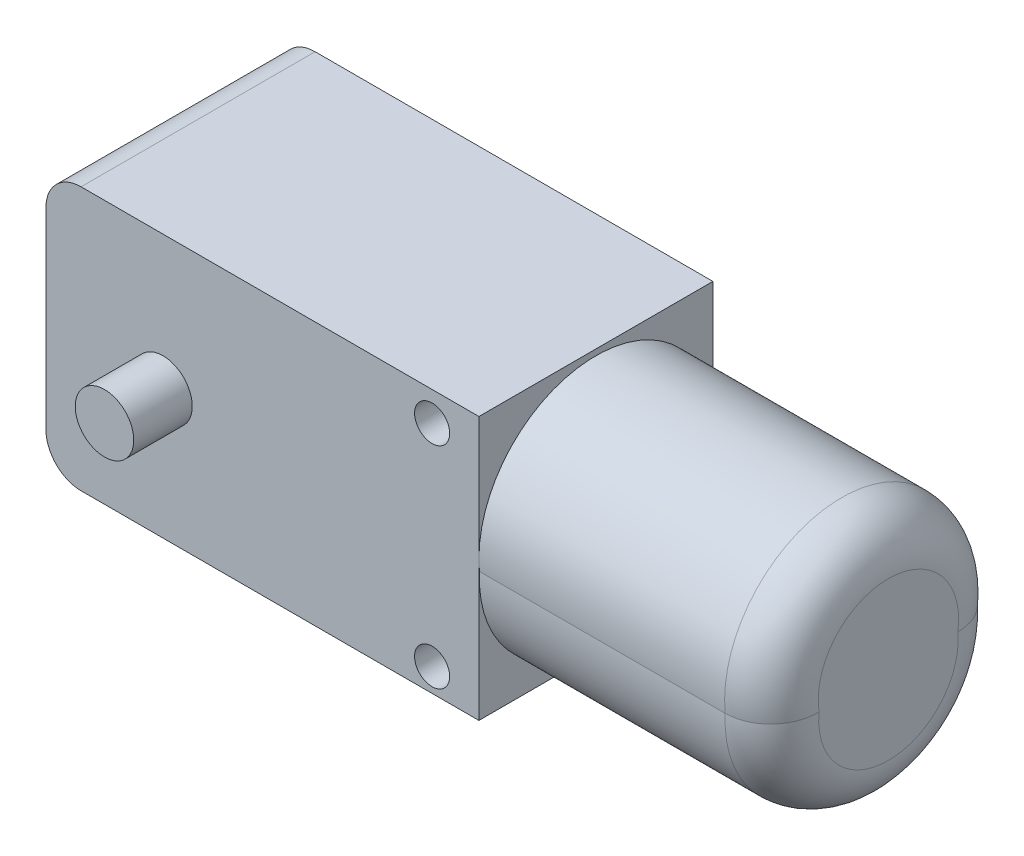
ISO-10303-21;
HEADER;
FILE_DESCRIPTION(('STEP AP214'),'2;1');
FILE_NAME('part.step','',(''),(''),'','','');
FILE_SCHEMA(('AUTOMOTIVE_DESIGN { 1 0 10303 214 1 1 1 1 }'));
ENDSEC;
DATA;
#1=APPLICATION_CONTEXT('core data for automotive mechanical design processes');
#2=APPLICATION_PROTOCOL_DEFINITION('international standard','automotive_design',2000,#1);
#3=PRODUCT_CONTEXT('',#1,'mechanical');
#4=PRODUCT('Part','Part','',(#3));
#5=PRODUCT_RELATED_PRODUCT_CATEGORY('part','',(#4));
#6=PRODUCT_DEFINITION_FORMATION('','',#4);
#7=PRODUCT_DEFINITION_CONTEXT('part definition',#1,'design');
#8=PRODUCT_DEFINITION('design','',#6,#7);
#9=PRODUCT_DEFINITION_SHAPE('','',#8);
#10=(LENGTH_UNIT() NAMED_UNIT(*) SI_UNIT(.MILLI.,.METRE.));
#11=(NAMED_UNIT(*) PLANE_ANGLE_UNIT() SI_UNIT($,.RADIAN.));
#12=(NAMED_UNIT(*) SI_UNIT($,.STERADIAN.) SOLID_ANGLE_UNIT());
#13=UNCERTAINTY_MEASURE_WITH_UNIT(LENGTH_MEASURE(1.E-05),#10,'distance_accuracy_value','');
#14=(GEOMETRIC_REPRESENTATION_CONTEXT(3) GLOBAL_UNCERTAINTY_ASSIGNED_CONTEXT((#13)) GLOBAL_UNIT_ASSIGNED_CONTEXT((#10,
#11,#12)) REPRESENTATION_CONTEXT('',''));
#15=CARTESIAN_POINT('',(0.,0.,0.));
#16=DIRECTION('',(0.,0.,1.));
#17=DIRECTION('',(1.,0.,0.));
#18=AXIS2_PLACEMENT_3D('',#15,#16,#17);
#19=CARTESIAN_POINT('',(-64.2641007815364,-2.5,-20.));
#20=DIRECTION('',(-1.,0.,0.));
#21=DIRECTION('',(0.,0.,1.));
#22=AXIS2_PLACEMENT_3D('',#19,#20,#21);
#23=PLANE('',#22);
#24=DIRECTION('',(0.,-1.,0.));
#25=VECTOR('',#24,1.);
#26=CARTESIAN_POINT('',(-64.2641007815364,-2.5,0.));
#27=LINE('',#26,#25);
#28=CARTESIAN_POINT('',(-64.2641007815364,-5.5,0.));
#29=VERTEX_POINT('',#28);
#30=CARTESIAN_POINT('',(-64.2641007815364,-22.,0.));
#31=VERTEX_POINT('',#30);
#32=EDGE_CURVE('E204',#29,#31,#27,.T.);
#33=ORIENTED_EDGE('',*,*,#32,.F.);
#34=DIRECTION('',(0.,0.,1.));
#35=VECTOR('',#34,1.);
#36=CARTESIAN_POINT('',(-64.2641007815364,-5.5,-20.));
#37=LINE('',#36,#35);
#38=CARTESIAN_POINT('',(-64.2641007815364,-5.5,-20.));
#39=VERTEX_POINT('',#38);
#40=EDGE_CURVE('E262',#29,#39,#37,.F.);
#41=ORIENTED_EDGE('',*,*,#40,.T.);
#42=DIRECTION('',(0.,-1.,0.));
#43=VECTOR('',#42,1.);
#44=CARTESIAN_POINT('',(-64.2641007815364,-2.5,-20.));
#45=LINE('',#44,#43);
#46=CARTESIAN_POINT('',(-64.2641007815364,-22.,-20.));
#47=VERTEX_POINT('',#46);
#48=EDGE_CURVE('E205',#39,#47,#45,.T.);
#49=ORIENTED_EDGE('',*,*,#48,.T.);
#50=DIRECTION('',(0.,0.,1.));
#51=VECTOR('',#50,1.);
#52=CARTESIAN_POINT('',(-64.2641007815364,-22.,-20.));
#53=LINE('',#52,#51);
#54=EDGE_CURVE('E258',#47,#31,#53,.T.);
#55=ORIENTED_EDGE('',*,*,#54,.T.);
#56=EDGE_LOOP('',(#33,#41,#49,#55));
#57=FACE_BOUND('',#56,.T.);
#58=DIRECTION('',(0.,0.,-1.));
#59=VECTOR('',#58,1.);
#60=CARTESIAN_POINT('',(-64.2641007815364,-11.25,-8.625));
#61=LINE('',#60,#59);
#62=CARTESIAN_POINT('',(-64.2641007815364,-11.25,-8.625));
#63=VERTEX_POINT('',#62);
#64=CARTESIAN_POINT('',(-64.2641007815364,-11.25,-11.375));
#65=VERTEX_POINT('',#64);
#66=EDGE_CURVE('E416',#63,#65,#61,.T.);
#67=ORIENTED_EDGE('',*,*,#66,.F.);
#68=DIRECTION('',(0.,1.,0.));
#69=VECTOR('',#68,1.);
#70=CARTESIAN_POINT('',(-64.2641007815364,-16.25,-8.625));
#71=LINE('',#70,#69);
#72=CARTESIAN_POINT('',(-64.2641007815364,-16.25,-8.625));
#73=VERTEX_POINT('',#72);
#74=EDGE_CURVE('E167',#73,#63,#71,.T.);
#75=ORIENTED_EDGE('',*,*,#74,.F.);
#76=DIRECTION('',(0.,0.,1.));
#77=VECTOR('',#76,1.);
#78=CARTESIAN_POINT('',(-64.2641007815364,-16.25,-8.625));
#79=LINE('',#78,#77);
#80=CARTESIAN_POINT('',(-64.2641007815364,-16.25,-11.375));
#81=VERTEX_POINT('',#80);
#82=EDGE_CURVE('E163',#81,#73,#79,.T.);
#83=ORIENTED_EDGE('',*,*,#82,.F.);
#84=DIRECTION('',(0.,-1.,0.));
#85=VECTOR('',#84,1.);
#86=CARTESIAN_POINT('',(-64.2641007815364,-16.25,-11.375));
#87=LINE('',#86,#85);
#88=EDGE_CURVE('E419',#65,#81,#87,.T.);
#89=ORIENTED_EDGE('',*,*,#88,.F.);
#90=EDGE_LOOP('',(#67,#75,#83,#89));
#91=FACE_BOUND('',#90,.T.);
#92=ADVANCED_FACE('F36',(#57,#91),#23,.T.);
#93=CARTESIAN_POINT('',(-27.2641007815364,-2.5,-20.));
#94=DIRECTION('',(1.,0.,0.));
#95=DIRECTION('',(0.,1.,0.));
#96=AXIS2_PLACEMENT_3D('',#93,#94,#95);
#97=PLANE('',#96);
#98=CARTESIAN_POINT('',(-27.2641007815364,-13.,-10.));
#99=DIRECTION('',(1.,0.,0.));
#100=DIRECTION('',(0.,1.,0.));
#101=AXIS2_PLACEMENT_3D('',#98,#99,#100);
#102=CIRCLE('',#101,10.);
#103=CARTESIAN_POINT('',(-27.2641007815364,-14.,-19.9498743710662));
#104=VERTEX_POINT('',#103);
#105=CARTESIAN_POINT('',(-27.2641007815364,-13.,-20.));
#106=VERTEX_POINT('',#105);
#107=EDGE_CURVE('E186',#104,#106,#102,.T.);
#108=ORIENTED_EDGE('',*,*,#107,.F.);
#109=CARTESIAN_POINT('',(-27.2641007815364,-14.5,-10.));
#110=DIRECTION('',(1.,0.,0.));
#111=DIRECTION('',(0.,1.,0.));
#112=AXIS2_PLACEMENT_3D('',#109,#110,#111);
#113=CIRCLE('',#112,9.96242942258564);
#114=CARTESIAN_POINT('',(-27.2641007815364,-14.,-0.050125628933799));
#115=VERTEX_POINT('',#114);
#116=EDGE_CURVE('E192',#115,#104,#113,.T.);
#117=ORIENTED_EDGE('',*,*,#116,.F.);
#118=CARTESIAN_POINT('',(-27.2641007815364,-13.,0.));
#119=VERTEX_POINT('',#118);
#120=EDGE_CURVE('E194',#119,#115,#102,.T.);
#121=ORIENTED_EDGE('',*,*,#120,.F.);
#122=DIRECTION('',(0.,1.,0.));
#123=VECTOR('',#122,1.);
#124=CARTESIAN_POINT('',(-27.2641007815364,-2.5,0.));
#125=LINE('',#124,#123);
#126=CARTESIAN_POINT('',(-27.2641007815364,-25.,0.));
#127=VERTEX_POINT('',#126);
#128=EDGE_CURVE('E230',#127,#119,#125,.T.);
#129=ORIENTED_EDGE('',*,*,#128,.F.);
#130=DIRECTION('',(0.,0.,1.));
#131=VECTOR('',#130,1.);
#132=CARTESIAN_POINT('',(-27.2641007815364,-25.,-20.));
#133=LINE('',#132,#131);
#134=CARTESIAN_POINT('',(-27.2641007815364,-25.,-20.));
#135=VERTEX_POINT('',#134);
#136=EDGE_CURVE('E222',#135,#127,#133,.T.);
#137=ORIENTED_EDGE('',*,*,#136,.F.);
#138=DIRECTION('',(0.,1.,0.));
#139=VECTOR('',#138,1.);
#140=CARTESIAN_POINT('',(-27.2641007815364,-2.5,-20.));
#141=LINE('',#140,#139);
#142=EDGE_CURVE('E214',#135,#106,#141,.T.);
#143=ORIENTED_EDGE('',*,*,#142,.T.);
#144=EDGE_LOOP('',(#108,#117,#121,#129,#137,#143));
#145=FACE_BOUND('',#144,.T.);
#146=ADVANCED_FACE('F308',(#145),#97,.T.);
#147=CARTESIAN_POINT('',(-64.2641007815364,-2.5,-20.));
#148=DIRECTION('',(0.,1.,0.));
#149=DIRECTION('',(0.,0.,1.));
#150=AXIS2_PLACEMENT_3D('',#147,#148,#149);
#151=PLANE('',#150);
#152=DIRECTION('',(-1.,0.,0.));
#153=VECTOR('',#152,1.);
#154=CARTESIAN_POINT('',(-64.2641007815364,-2.5,-20.));
#155=LINE('',#154,#153);
#156=CARTESIAN_POINT('',(-27.2641007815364,-2.5,-20.));
#157=VERTEX_POINT('',#156);
#158=CARTESIAN_POINT('',(-61.2641007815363,-2.5,-20.));
#159=VERTEX_POINT('',#158);
#160=EDGE_CURVE('E218',#157,#159,#155,.T.);
#161=ORIENTED_EDGE('',*,*,#160,.T.);
#162=DIRECTION('',(0.,0.,1.));
#163=VECTOR('',#162,1.);
#164=CARTESIAN_POINT('',(-61.2641007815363,-2.5,-20.));
#165=LINE('',#164,#163);
#166=CARTESIAN_POINT('',(-61.2641007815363,-2.5,0.));
#167=VERTEX_POINT('',#166);
#168=EDGE_CURVE('E248',#159,#167,#165,.T.);
#169=ORIENTED_EDGE('',*,*,#168,.T.);
#170=DIRECTION('',(-1.,0.,0.));
#171=VECTOR('',#170,1.);
#172=CARTESIAN_POINT('',(-64.2641007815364,-2.5,0.));
#173=LINE('',#172,#171);
#174=CARTESIAN_POINT('',(-27.2641007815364,-2.5,0.));
#175=VERTEX_POINT('',#174);
#176=EDGE_CURVE('E210',#175,#167,#173,.T.);
#177=ORIENTED_EDGE('',*,*,#176,.F.);
#178=DIRECTION('',(0.,0.,1.));
#179=VECTOR('',#178,1.);
#180=CARTESIAN_POINT('',(-27.2641007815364,-2.5,-20.));
#181=LINE('',#180,#179);
#182=EDGE_CURVE('E237',#157,#175,#181,.T.);
#183=ORIENTED_EDGE('',*,*,#182,.F.);
#184=EDGE_LOOP('',(#161,#169,#177,#183));
#185=FACE_BOUND('',#184,.T.);
#186=ADVANCED_FACE('F318',(#185),#151,.T.);
#187=EDGE_CURVE('E193',#106,#119,#102,.T.);
#188=ORIENTED_EDGE('',*,*,#187,.F.);
#189=EDGE_CURVE('E213',#106,#157,#141,.T.);
#190=ORIENTED_EDGE('',*,*,#189,.T.);
#191=ORIENTED_EDGE('',*,*,#182,.T.);
#192=EDGE_CURVE('E229',#119,#175,#125,.T.);
#193=ORIENTED_EDGE('',*,*,#192,.F.);
#194=EDGE_LOOP('',(#188,#190,#191,#193));
#195=FACE_BOUND('',#194,.T.);
#196=ADVANCED_FACE('F314',(#195),#97,.T.);
#197=CARTESIAN_POINT('',(-64.2641007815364,-25.,-20.));
#198=DIRECTION('',(0.,-1.,0.));
#199=DIRECTION('',(0.,0.,-1.));
#200=AXIS2_PLACEMENT_3D('',#197,#198,#199);
#201=PLANE('',#200);
#202=DIRECTION('',(1.,0.,0.));
#203=VECTOR('',#202,1.);
#204=CARTESIAN_POINT('',(-64.2641007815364,-25.,0.));
#205=LINE('',#204,#203);
#206=CARTESIAN_POINT('',(-61.2641007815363,-25.,0.));
#207=VERTEX_POINT('',#206);
#208=EDGE_CURVE('E226',#207,#127,#205,.T.);
#209=ORIENTED_EDGE('',*,*,#208,.F.);
#210=DIRECTION('',(0.,0.,1.));
#211=VECTOR('',#210,1.);
#212=CARTESIAN_POINT('',(-61.2641007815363,-25.,-20.));
#213=LINE('',#212,#211);
#214=CARTESIAN_POINT('',(-61.2641007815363,-25.,-20.));
#215=VERTEX_POINT('',#214);
#216=EDGE_CURVE('E270',#207,#215,#213,.F.);
#217=ORIENTED_EDGE('',*,*,#216,.T.);
#218=DIRECTION('',(1.,0.,0.));
#219=VECTOR('',#218,1.);
#220=CARTESIAN_POINT('',(-64.2641007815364,-25.,-20.));
#221=LINE('',#220,#219);
#222=EDGE_CURVE('E209',#215,#135,#221,.T.);
#223=ORIENTED_EDGE('',*,*,#222,.T.);
#224=ORIENTED_EDGE('',*,*,#136,.T.);
#225=EDGE_LOOP('',(#209,#217,#223,#224));
#226=FACE_BOUND('',#225,.T.);
#227=ADVANCED_FACE('F310',(#226),#201,.T.);
#228=CARTESIAN_POINT('',(0.,0.,-20.));
#229=DIRECTION('',(0.,0.,1.));
#230=DIRECTION('',(1.,0.,0.));
#231=AXIS2_PLACEMENT_3D('',#228,#229,#230);
#232=PLANE('',#231);
#233=CARTESIAN_POINT('',(-31.2641007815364,-23.,-20.));
#234=DIRECTION('',(0.,0.,-1.));
#235=DIRECTION('',(-1.,0.,0.));
#236=AXIS2_PLACEMENT_3D('',#233,#234,#235);
#237=CIRCLE('',#236,1.5);
#238=CARTESIAN_POINT('',(-32.7641007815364,-23.,-20.));
#239=VERTEX_POINT('',#238);
#240=EDGE_CURVE('E389',#239,#239,#237,.T.);
#241=ORIENTED_EDGE('',*,*,#240,.F.);
#242=EDGE_LOOP('',(#241));
#243=FACE_BOUND('',#242,.T.);
#244=CARTESIAN_POINT('',(-31.2641007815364,-4.99999999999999,-20.));
#245=DIRECTION('',(0.,0.,-1.));
#246=DIRECTION('',(-1.,0.,0.));
#247=AXIS2_PLACEMENT_3D('',#244,#245,#246);
#248=CIRCLE('',#247,1.5);
#249=CARTESIAN_POINT('',(-32.7641007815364,-4.99999999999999,-20.));
#250=VERTEX_POINT('',#249);
#251=EDGE_CURVE('E395',#250,#250,#248,.T.);
#252=ORIENTED_EDGE('',*,*,#251,.F.);
#253=EDGE_LOOP('',(#252));
#254=FACE_BOUND('',#253,.T.);
#255=CARTESIAN_POINT('',(-54.2641007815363,-14.,-20.));
#256=DIRECTION('',(0.,0.,1.));
#257=DIRECTION('',(1.,0.,0.));
#258=AXIS2_PLACEMENT_3D('',#255,#256,#257);
#259=CIRCLE('',#258,2.5);
#260=CARTESIAN_POINT('',(-51.7641007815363,-14.,-20.));
#261=VERTEX_POINT('',#260);
#262=EDGE_CURVE('E244',#261,#261,#259,.F.);
#263=ORIENTED_EDGE('',*,*,#262,.F.);
#264=EDGE_LOOP('',(#263));
#265=FACE_BOUND('',#264,.T.);
#266=ORIENTED_EDGE('',*,*,#48,.F.);
#267=CARTESIAN_POINT('',(-61.2641007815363,-5.5,-20.));
#268=DIRECTION('',(0.,0.,1.));
#269=DIRECTION('',(1.,0.,0.));
#270=AXIS2_PLACEMENT_3D('',#267,#268,#269);
#271=CIRCLE('',#270,3.);
#272=EDGE_CURVE('E267',#39,#159,#271,.F.);
#273=ORIENTED_EDGE('',*,*,#272,.T.);
#274=ORIENTED_EDGE('',*,*,#160,.F.);
#275=ORIENTED_EDGE('',*,*,#189,.F.);
#276=ORIENTED_EDGE('',*,*,#142,.F.);
#277=ORIENTED_EDGE('',*,*,#222,.F.);
#278=CARTESIAN_POINT('',(-61.2641007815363,-22.,-20.));
#279=DIRECTION('',(0.,0.,1.));
#280=DIRECTION('',(1.,0.,0.));
#281=AXIS2_PLACEMENT_3D('',#278,#279,#280);
#282=CIRCLE('',#281,3.);
#283=EDGE_CURVE('E265',#215,#47,#282,.F.);
#284=ORIENTED_EDGE('',*,*,#283,.T.);
#285=EDGE_LOOP('',(#266,#273,#274,#275,#276,#277,#284));
#286=FACE_BOUND('',#285,.T.);
#287=ADVANCED_FACE('F313',(#243,#254,#265,#286),#232,.F.);
#288=CARTESIAN_POINT('',(0.,0.,0.));
#289=DIRECTION('',(0.,0.,1.));
#290=DIRECTION('',(1.,0.,0.));
#291=AXIS2_PLACEMENT_3D('',#288,#289,#290);
#292=PLANE('',#291);
#293=CARTESIAN_POINT('',(-31.2641007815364,-23.,0.));
#294=DIRECTION('',(0.,0.,1.));
#295=DIRECTION('',(1.,0.,0.));
#296=AXIS2_PLACEMENT_3D('',#293,#294,#295);
#297=CIRCLE('',#296,1.5);
#298=CARTESIAN_POINT('',(-29.7641007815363,-23.,0.));
#299=VERTEX_POINT('',#298);
#300=EDGE_CURVE('E41',#299,#299,#297,.T.);
#301=ORIENTED_EDGE('',*,*,#300,.F.);
#302=EDGE_LOOP('',(#301));
#303=FACE_BOUND('',#302,.T.);
#304=CARTESIAN_POINT('',(-31.2641007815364,-4.99999999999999,0.));
#305=DIRECTION('',(0.,0.,1.));
#306=DIRECTION('',(1.,0.,0.));
#307=AXIS2_PLACEMENT_3D('',#304,#305,#306);
#308=CIRCLE('',#307,1.5);
#309=CARTESIAN_POINT('',(-29.7641007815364,-4.99999999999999,0.));
#310=VERTEX_POINT('',#309);
#311=EDGE_CURVE('E400',#310,#310,#308,.T.);
#312=ORIENTED_EDGE('',*,*,#311,.F.);
#313=EDGE_LOOP('',(#312));
#314=FACE_BOUND('',#313,.T.);
#315=CARTESIAN_POINT('',(-54.2641007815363,-14.,0.));
#316=DIRECTION('',(0.,0.,1.));
#317=DIRECTION('',(1.,0.,0.));
#318=AXIS2_PLACEMENT_3D('',#315,#316,#317);
#319=CIRCLE('',#318,2.5);
#320=CARTESIAN_POINT('',(-51.7641007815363,-14.,0.));
#321=VERTEX_POINT('',#320);
#322=EDGE_CURVE('E181',#321,#321,#319,.T.);
#323=ORIENTED_EDGE('',*,*,#322,.F.);
#324=EDGE_LOOP('',(#323));
#325=FACE_BOUND('',#324,.T.);
#326=ORIENTED_EDGE('',*,*,#176,.T.);
#327=CARTESIAN_POINT('',(-61.2641007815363,-5.5,0.));
#328=DIRECTION('',(0.,0.,1.));
#329=DIRECTION('',(1.,0.,0.));
#330=AXIS2_PLACEMENT_3D('',#327,#328,#329);
#331=CIRCLE('',#330,3.);
#332=EDGE_CURVE('E255',#167,#29,#331,.T.);
#333=ORIENTED_EDGE('',*,*,#332,.T.);
#334=ORIENTED_EDGE('',*,*,#32,.T.);
#335=CARTESIAN_POINT('',(-61.2641007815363,-22.,0.));
#336=DIRECTION('',(0.,0.,1.));
#337=DIRECTION('',(1.,0.,0.));
#338=AXIS2_PLACEMENT_3D('',#335,#336,#337);
#339=CIRCLE('',#338,3.);
#340=EDGE_CURVE('E252',#31,#207,#339,.T.);
#341=ORIENTED_EDGE('',*,*,#340,.T.);
#342=ORIENTED_EDGE('',*,*,#208,.T.);
#343=ORIENTED_EDGE('',*,*,#128,.T.);
#344=ORIENTED_EDGE('',*,*,#192,.T.);
#345=EDGE_LOOP('',(#326,#333,#334,#341,#342,#343,#344));
#346=FACE_BOUND('',#345,.T.);
#347=ADVANCED_FACE('F323',(#303,#314,#325,#346),#292,.T.);
#348=CARTESIAN_POINT('',(-2.26410078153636,-13.,-10.));
#349=DIRECTION('',(-1.,0.,0.));
#350=DIRECTION('',(0.,-1.,0.));
#351=AXIS2_PLACEMENT_3D('',#348,#349,#350);
#352=CYLINDRICAL_SURFACE('',#351,10.);
#353=DIRECTION('',(-1.,0.,0.));
#354=VECTOR('',#353,1.);
#355=CARTESIAN_POINT('',(-2.26410078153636,-14.,-0.050125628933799));
#356=LINE('',#355,#354);
#357=CARTESIAN_POINT('',(-6.26410078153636,-14.,-0.050125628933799));
#358=VERTEX_POINT('',#357);
#359=EDGE_CURVE('E201',#358,#115,#356,.T.);
#360=ORIENTED_EDGE('',*,*,#359,.F.);
#361=CARTESIAN_POINT('',(-6.26410078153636,-13.,-10.));
#362=DIRECTION('',(1.,0.,0.));
#363=DIRECTION('',(0.,1.,0.));
#364=AXIS2_PLACEMENT_3D('',#361,#362,#363);
#365=CIRCLE('',#364,10.);
#366=CARTESIAN_POINT('',(-6.26410078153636,-14.,-19.9498743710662));
#367=VERTEX_POINT('',#366);
#368=EDGE_CURVE('E47',#358,#367,#365,.F.);
#369=ORIENTED_EDGE('',*,*,#368,.T.);
#370=DIRECTION('',(-1.,0.,0.));
#371=VECTOR('',#370,1.);
#372=CARTESIAN_POINT('',(-2.26410078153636,-14.,-19.9498743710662));
#373=LINE('',#372,#371);
#374=EDGE_CURVE('E198',#367,#104,#373,.T.);
#375=ORIENTED_EDGE('',*,*,#374,.T.);
#376=ORIENTED_EDGE('',*,*,#107,.T.);
#377=ORIENTED_EDGE('',*,*,#187,.T.);
#378=ORIENTED_EDGE('',*,*,#120,.T.);
#379=EDGE_LOOP('',(#360,#369,#375,#376,#377,#378));
#380=FACE_BOUND('',#379,.T.);
#381=ADVANCED_FACE('F326',(#380),#352,.T.);
#382=CARTESIAN_POINT('',(-2.26410078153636,-14.5,-10.));
#383=DIRECTION('',(-1.,0.,0.));
#384=DIRECTION('',(0.,-1.,0.));
#385=AXIS2_PLACEMENT_3D('',#382,#383,#384);
#386=CYLINDRICAL_SURFACE('',#385,9.96242942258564);
#387=ORIENTED_EDGE('',*,*,#374,.F.);
#388=CARTESIAN_POINT('',(-6.26410078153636,-14.5,-10.));
#389=DIRECTION('',(1.,0.,0.));
#390=DIRECTION('',(0.,1.,0.));
#391=AXIS2_PLACEMENT_3D('',#388,#389,#390);
#392=CIRCLE('',#391,9.96242942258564);
#393=EDGE_CURVE('E11',#367,#358,#392,.F.);
#394=ORIENTED_EDGE('',*,*,#393,.T.);
#395=ORIENTED_EDGE('',*,*,#359,.T.);
#396=ORIENTED_EDGE('',*,*,#116,.T.);
#397=EDGE_LOOP('',(#387,#394,#395,#396));
#398=FACE_BOUND('',#397,.T.);
#399=ADVANCED_FACE('F333',(#398),#386,.T.);
#400=CARTESIAN_POINT('',(-2.26410078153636,-13.75,-10.));
#401=DIRECTION('',(1.,0.,0.));
#402=DIRECTION('',(0.,1.,0.));
#403=AXIS2_PLACEMENT_3D('',#400,#401,#402);
#404=PLANE('',#403);
#405=CARTESIAN_POINT('',(-2.26410078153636,-14.5,-10.));
#406=DIRECTION('',(1.,0.,0.));
#407=DIRECTION('',(0.,1.,0.));
#408=AXIS2_PLACEMENT_3D('',#405,#406,#407);
#409=CIRCLE('',#408,5.96242942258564);
#410=CARTESIAN_POINT('',(-2.26410078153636,-13.8998117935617,-4.06785546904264));
#411=VERTEX_POINT('',#410);
#412=CARTESIAN_POINT('',(-2.26410078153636,-13.8998117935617,-15.9321445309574));
#413=VERTEX_POINT('',#412);
#414=EDGE_CURVE('E273',#411,#413,#409,.T.);
#415=ORIENTED_EDGE('',*,*,#414,.T.);
#416=CARTESIAN_POINT('',(-2.26410078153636,-13.,-10.));
#417=DIRECTION('',(1.,0.,0.));
#418=DIRECTION('',(0.,1.,0.));
#419=AXIS2_PLACEMENT_3D('',#416,#417,#418);
#420=CIRCLE('',#419,6.00000000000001);
#421=EDGE_CURVE('E276',#413,#411,#420,.T.);
#422=ORIENTED_EDGE('',*,*,#421,.T.);
#423=EDGE_LOOP('',(#415,#422));
#424=FACE_BOUND('',#423,.T.);
#425=ADVANCED_FACE('F337',(#424),#404,.T.);
#426=CARTESIAN_POINT('',(-54.2641007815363,-14.,5.));
#427=DIRECTION('',(0.,0.,-1.));
#428=DIRECTION('',(-1.,0.,0.));
#429=AXIS2_PLACEMENT_3D('',#426,#427,#428);
#430=CYLINDRICAL_SURFACE('',#429,2.5);
#431=CARTESIAN_POINT('',(-54.2641007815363,-14.,5.));
#432=DIRECTION('',(0.,0.,1.));
#433=DIRECTION('',(1.,0.,0.));
#434=AXIS2_PLACEMENT_3D('',#431,#432,#433);
#435=CIRCLE('',#434,2.5);
#436=CARTESIAN_POINT('',(-51.7641007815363,-14.,5.));
#437=VERTEX_POINT('',#436);
#438=EDGE_CURVE('E182',#437,#437,#435,.T.);
#439=ORIENTED_EDGE('',*,*,#438,.F.);
#440=EDGE_LOOP('',(#439));
#441=FACE_BOUND('',#440,.T.);
#442=ORIENTED_EDGE('',*,*,#322,.T.);
#443=EDGE_LOOP('',(#442));
#444=FACE_BOUND('',#443,.T.);
#445=ADVANCED_FACE('F341',(#441,#444),#430,.T.);
#446=CARTESIAN_POINT('',(-54.2641007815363,-14.,5.));
#447=DIRECTION('',(0.,0.,1.));
#448=DIRECTION('',(1.,0.,0.));
#449=AXIS2_PLACEMENT_3D('',#446,#447,#448);
#450=PLANE('',#449);
#451=ORIENTED_EDGE('',*,*,#438,.T.);
#452=EDGE_LOOP('',(#451));
#453=FACE_BOUND('',#452,.T.);
#454=ADVANCED_FACE('F345',(#453),#450,.T.);
#455=CARTESIAN_POINT('',(-54.2641007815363,-14.,-25.));
#456=DIRECTION('',(0.,0.,1.));
#457=DIRECTION('',(1.,0.,0.));
#458=AXIS2_PLACEMENT_3D('',#455,#456,#457);
#459=CYLINDRICAL_SURFACE('',#458,2.5);
#460=CARTESIAN_POINT('',(-54.2641007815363,-14.,-25.));
#461=DIRECTION('',(0.,0.,-1.));
#462=DIRECTION('',(-1.,0.,0.));
#463=AXIS2_PLACEMENT_3D('',#460,#461,#462);
#464=CIRCLE('',#463,2.5);
#465=CARTESIAN_POINT('',(-56.7641007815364,-14.,-25.));
#466=VERTEX_POINT('',#465);
#467=EDGE_CURVE('E177',#466,#466,#464,.T.);
#468=ORIENTED_EDGE('',*,*,#467,.F.);
#469=EDGE_LOOP('',(#468));
#470=FACE_BOUND('',#469,.T.);
#471=ORIENTED_EDGE('',*,*,#262,.T.);
#472=EDGE_LOOP('',(#471));
#473=FACE_BOUND('',#472,.T.);
#474=ADVANCED_FACE('F349',(#470,#473),#459,.T.);
#475=CARTESIAN_POINT('',(-54.2641007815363,-14.,-25.));
#476=DIRECTION('',(0.,0.,-1.));
#477=DIRECTION('',(-1.,0.,0.));
#478=AXIS2_PLACEMENT_3D('',#475,#476,#477);
#479=PLANE('',#478);
#480=ORIENTED_EDGE('',*,*,#467,.T.);
#481=EDGE_LOOP('',(#480));
#482=FACE_BOUND('',#481,.T.);
#483=ADVANCED_FACE('F304',(#482),#479,.T.);
#484=CARTESIAN_POINT('',(-61.2641007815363,-5.5,-20.));
#485=DIRECTION('',(0.,0.,1.));
#486=DIRECTION('',(1.,0.,0.));
#487=AXIS2_PLACEMENT_3D('',#484,#485,#486);
#488=CYLINDRICAL_SURFACE('',#487,3.);
#489=ORIENTED_EDGE('',*,*,#272,.F.);
#490=ORIENTED_EDGE('',*,*,#40,.F.);
#491=ORIENTED_EDGE('',*,*,#332,.F.);
#492=ORIENTED_EDGE('',*,*,#168,.F.);
#493=EDGE_LOOP('',(#489,#490,#491,#492));
#494=FACE_BOUND('',#493,.T.);
#495=ADVANCED_FACE('F300',(#494),#488,.T.);
#496=CARTESIAN_POINT('',(-61.2641007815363,-22.,-20.));
#497=DIRECTION('',(0.,0.,1.));
#498=DIRECTION('',(1.,0.,0.));
#499=AXIS2_PLACEMENT_3D('',#496,#497,#498);
#500=CYLINDRICAL_SURFACE('',#499,3.);
#501=ORIENTED_EDGE('',*,*,#283,.F.);
#502=ORIENTED_EDGE('',*,*,#216,.F.);
#503=ORIENTED_EDGE('',*,*,#340,.F.);
#504=ORIENTED_EDGE('',*,*,#54,.F.);
#505=EDGE_LOOP('',(#501,#502,#503,#504));
#506=FACE_BOUND('',#505,.T.);
#507=ADVANCED_FACE('F295',(#506),#500,.T.);
#508=CARTESIAN_POINT('',(-6.26410078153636,-14.5,-10.));
#509=DIRECTION('',(1.,0.,0.));
#510=DIRECTION('',(0.,1.,0.));
#511=AXIS2_PLACEMENT_3D('',#508,#509,#510);
#512=TOROIDAL_SURFACE('',#511,5.96242942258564,4.);
#513=CARTESIAN_POINT('',(-6.26410078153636,-14.,-0.0501256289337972));
#514=CARTESIAN_POINT('',(-6.15185902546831,-14.000000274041,-0.0501147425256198));
#515=CARTESIAN_POINT('',(-6.03962243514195,-13.9998816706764,-0.0548618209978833));
#516=CARTESIAN_POINT('',(-5.815953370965,-13.9994088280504,-0.0737876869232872));
#517=CARTESIAN_POINT('',(-5.70452085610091,-13.9990546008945,-0.0879659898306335));
#518=CARTESIAN_POINT('',(-5.48332479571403,-13.9981129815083,-0.125655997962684));
#519=CARTESIAN_POINT('',(-5.3735600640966,-13.9975257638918,-0.149160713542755));
#520=CARTESIAN_POINT('',(-5.15642855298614,-13.9961230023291,-0.20531106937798));
#521=CARTESIAN_POINT('',(-5.04906174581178,-13.99530746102,-0.237956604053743));
#522=CARTESIAN_POINT('',(-4.73159871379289,-13.9925251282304,-0.349335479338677));
#523=CARTESIAN_POINT('',(-4.52604457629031,-13.9902222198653,-0.441527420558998));
#524=CARTESIAN_POINT('',(-4.13347860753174,-13.9847903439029,-0.659007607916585));
#525=CARTESIAN_POINT('',(-3.94646280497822,-13.9816615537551,-0.784288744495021));
#526=CARTESIAN_POINT('',(-3.59589185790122,-13.9746639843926,-1.06452948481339));
#527=CARTESIAN_POINT('',(-3.43235672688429,-13.9707945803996,-1.21951414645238));
#528=CARTESIAN_POINT('',(-3.13351486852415,-13.962427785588,-1.55471533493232));
#529=CARTESIAN_POINT('',(-2.99821659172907,-13.9579302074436,-1.7349393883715));
#530=CARTESIAN_POINT('',(-2.75931111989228,-13.9484243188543,-2.11597355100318));
#531=CARTESIAN_POINT('',(-2.65579536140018,-13.9434145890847,-2.31684087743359));
#532=CARTESIAN_POINT('',(-2.48386016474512,-13.9330401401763,-2.73298703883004));
#533=CARTESIAN_POINT('',(-2.41541665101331,-13.9276756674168,-2.94825587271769));
#534=CARTESIAN_POINT('',(-2.33262323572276,-13.9186388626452,-3.31110103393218));
#535=CARTESIAN_POINT('',(-2.3077552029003,-13.9150219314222,-3.45638142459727));
#536=CARTESIAN_POINT('',(-2.27400606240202,-13.9077493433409,-3.748634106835));
#537=CARTESIAN_POINT('',(-2.26509821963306,-13.9040937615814,-3.8956031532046));
#538=CARTESIAN_POINT('',(-2.26412709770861,-13.9002319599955,-4.05095251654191));
#539=CARTESIAN_POINT('',(-2.26410071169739,-13.9000218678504,-4.05940421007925));
#540=CARTESIAN_POINT('',(-2.26410078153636,-13.8998117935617,-4.06785546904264));
#541=B_SPLINE_CURVE_WITH_KNOTS('',3,(#513,#514,#515,#516,#517,#518,#519,#520,#521,#522,#523,
#524,#525,#526,#527,#528,#529,#530,#531,#532,#533,#534,#535,#536,#537,#538,#539,#540),
.UNSPECIFIED.,.F.,.F.,(4,2,2,2,2,2,2,2,2,2,2,2,2,4),(0.,0.336615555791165,0.673213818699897,
1.00956029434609,1.34590288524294,2.01830164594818,2.69055605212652,3.36338008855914,
4.03640519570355,4.71134879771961,5.38582845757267,5.82738358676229,6.26819836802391,
6.29356120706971),.UNSPECIFIED.);
#542=EDGE_CURVE('E169',#358,#411,#541,.T.);
#543=ORIENTED_EDGE('',*,*,#542,.F.);
#544=ORIENTED_EDGE('',*,*,#393,.F.);
#545=CARTESIAN_POINT('',(-6.26410078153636,-14.,-19.9498743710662));
#546=CARTESIAN_POINT('',(-6.15185902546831,-14.000000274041,-19.9498852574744));
#547=CARTESIAN_POINT('',(-6.03962243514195,-13.9998816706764,-19.9451381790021));
#548=CARTESIAN_POINT('',(-5.815953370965,-13.9994088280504,-19.9262123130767));
#549=CARTESIAN_POINT('',(-5.70452085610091,-13.9990546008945,-19.9120340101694));
#550=CARTESIAN_POINT('',(-5.48332479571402,-13.9981129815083,-19.8743440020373));
#551=CARTESIAN_POINT('',(-5.3735600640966,-13.9975257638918,-19.8508392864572));
#552=CARTESIAN_POINT('',(-5.15642855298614,-13.996123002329,-19.794688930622));
#553=CARTESIAN_POINT('',(-5.04906174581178,-13.99530746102,-19.7620433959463));
#554=CARTESIAN_POINT('',(-4.73159871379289,-13.9925251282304,-19.6506645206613));
#555=CARTESIAN_POINT('',(-4.52604457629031,-13.9902222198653,-19.558472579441));
#556=CARTESIAN_POINT('',(-4.13347860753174,-13.9847903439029,-19.3409923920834));
#557=CARTESIAN_POINT('',(-3.94646280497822,-13.981661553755,-19.215711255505));
#558=CARTESIAN_POINT('',(-3.59589185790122,-13.9746639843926,-18.9354705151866));
#559=CARTESIAN_POINT('',(-3.43235672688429,-13.9707945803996,-18.7804858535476));
#560=CARTESIAN_POINT('',(-3.13351486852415,-13.962427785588,-18.4452846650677));
#561=CARTESIAN_POINT('',(-2.99821659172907,-13.9579302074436,-18.2650606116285));
#562=CARTESIAN_POINT('',(-2.75931111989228,-13.9484243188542,-17.8840264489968));
#563=CARTESIAN_POINT('',(-2.65579536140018,-13.9434145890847,-17.6831591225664));
#564=CARTESIAN_POINT('',(-2.48386016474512,-13.9330401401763,-17.26701296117));
#565=CARTESIAN_POINT('',(-2.41541665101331,-13.9276756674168,-17.0517441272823));
#566=CARTESIAN_POINT('',(-2.33262323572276,-13.9186388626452,-16.6888989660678));
#567=CARTESIAN_POINT('',(-2.3077552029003,-13.9150219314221,-16.5436185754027));
#568=CARTESIAN_POINT('',(-2.27400606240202,-13.9077493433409,-16.251365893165));
#569=CARTESIAN_POINT('',(-2.26509821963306,-13.9040937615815,-16.1043968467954));
#570=CARTESIAN_POINT('',(-2.26412709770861,-13.9002319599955,-15.9490474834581));
#571=CARTESIAN_POINT('',(-2.26410071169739,-13.9000218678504,-15.9405957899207));
#572=CARTESIAN_POINT('',(-2.26410078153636,-13.8998117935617,-15.9321445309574));
#573=B_SPLINE_CURVE_WITH_KNOTS('',3,(#545,#546,#547,#548,#549,#550,#551,#552,#553,#554,#555,
#556,#557,#558,#559,#560,#561,#562,#563,#564,#565,#566,#567,#568,#569,#570,#571,#572),
.UNSPECIFIED.,.F.,.F.,(4,2,2,2,2,2,2,2,2,2,2,2,2,4),(0.,0.336615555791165,0.673213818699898,
1.00956029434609,1.34590288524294,2.01830164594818,2.69055605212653,3.36338008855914,
4.03640519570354,4.71134879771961,5.38582845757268,5.82738358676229,6.26819836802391,
6.2935612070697),.UNSPECIFIED.);
#574=EDGE_CURVE('E63',#413,#367,#573,.F.);
#575=ORIENTED_EDGE('',*,*,#574,.F.);
#576=ORIENTED_EDGE('',*,*,#414,.F.);
#577=EDGE_LOOP('',(#543,#544,#575,#576));
#578=FACE_BOUND('',#577,.T.);
#579=ADVANCED_FACE('F291',(#578),#512,.T.);
#580=CARTESIAN_POINT('',(-6.26410078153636,-13.,-10.));
#581=DIRECTION('',(1.,0.,0.));
#582=DIRECTION('',(0.,1.,0.));
#583=AXIS2_PLACEMENT_3D('',#580,#581,#582);
#584=TOROIDAL_SURFACE('',#583,6.00000000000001,4.);
#585=ORIENTED_EDGE('',*,*,#574,.T.);
#586=ORIENTED_EDGE('',*,*,#368,.F.);
#587=ORIENTED_EDGE('',*,*,#542,.T.);
#588=ORIENTED_EDGE('',*,*,#421,.F.);
#589=EDGE_LOOP('',(#585,#586,#587,#588));
#590=FACE_BOUND('',#589,.T.);
#591=ADVANCED_FACE('F38',(#590),#584,.T.);
#592=CARTESIAN_POINT('',(-69.2641007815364,-16.25,-8.625));
#593=DIRECTION('',(0.,0.,-1.));
#594=DIRECTION('',(0.,1.,0.));
#595=AXIS2_PLACEMENT_3D('',#592,#593,#594);
#596=PLANE('',#595);
#597=CARTESIAN_POINT('',(-66.7641007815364,-13.75,-8.625));
#598=DIRECTION('',(0.,0.,-1.));
#599=DIRECTION('',(0.,1.,0.));
#600=AXIS2_PLACEMENT_3D('',#597,#598,#599);
#601=CIRCLE('',#600,1.5);
#602=CARTESIAN_POINT('',(-66.7641007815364,-12.25,-8.625));
#603=VERTEX_POINT('',#602);
#604=EDGE_CURVE('E405',#603,#603,#601,.F.);
#605=ORIENTED_EDGE('',*,*,#604,.F.);
#606=EDGE_LOOP('',(#605));
#607=FACE_BOUND('',#606,.T.);
#608=ORIENTED_EDGE('',*,*,#74,.T.);
#609=DIRECTION('',(1.,0.,0.));
#610=VECTOR('',#609,1.);
#611=CARTESIAN_POINT('',(-69.2641007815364,-11.25,-8.625));
#612=LINE('',#611,#610);
#613=CARTESIAN_POINT('',(-69.2641007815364,-11.25,-8.625));
#614=VERTEX_POINT('',#613);
#615=EDGE_CURVE('E146',#614,#63,#612,.T.);
#616=ORIENTED_EDGE('',*,*,#615,.F.);
#617=DIRECTION('',(0.,1.,0.));
#618=VECTOR('',#617,1.);
#619=CARTESIAN_POINT('',(-69.2641007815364,-16.25,-8.625));
#620=LINE('',#619,#618);
#621=CARTESIAN_POINT('',(-69.2641007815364,-16.25,-8.625));
#622=VERTEX_POINT('',#621);
#623=EDGE_CURVE('E154',#622,#614,#620,.T.);
#624=ORIENTED_EDGE('',*,*,#623,.F.);
#625=DIRECTION('',(1.,0.,0.));
#626=VECTOR('',#625,1.);
#627=CARTESIAN_POINT('',(-69.2641007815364,-16.25,-8.625));
#628=LINE('',#627,#626);
#629=EDGE_CURVE('E413',#622,#73,#628,.T.);
#630=ORIENTED_EDGE('',*,*,#629,.T.);
#631=EDGE_LOOP('',(#608,#616,#624,#630));
#632=FACE_BOUND('',#631,.T.);
#633=ADVANCED_FACE('F165',(#607,#632),#596,.F.);
#634=CARTESIAN_POINT('',(-69.2641007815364,-11.25,-8.625));
#635=DIRECTION('',(0.,-1.,0.));
#636=DIRECTION('',(0.,0.,-1.));
#637=AXIS2_PLACEMENT_3D('',#634,#635,#636);
#638=PLANE('',#637);
#639=ORIENTED_EDGE('',*,*,#66,.T.);
#640=DIRECTION('',(1.,0.,0.));
#641=VECTOR('',#640,1.);
#642=CARTESIAN_POINT('',(-69.2641007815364,-11.25,-11.375));
#643=LINE('',#642,#641);
#644=CARTESIAN_POINT('',(-69.2641007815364,-11.25,-11.375));
#645=VERTEX_POINT('',#644);
#646=EDGE_CURVE('E149',#645,#65,#643,.T.);
#647=ORIENTED_EDGE('',*,*,#646,.F.);
#648=DIRECTION('',(0.,0.,-1.));
#649=VECTOR('',#648,1.);
#650=CARTESIAN_POINT('',(-69.2641007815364,-11.25,-8.625));
#651=LINE('',#650,#649);
#652=EDGE_CURVE('E142',#614,#645,#651,.T.);
#653=ORIENTED_EDGE('',*,*,#652,.F.);
#654=ORIENTED_EDGE('',*,*,#615,.T.);
#655=EDGE_LOOP('',(#639,#647,#653,#654));
#656=FACE_BOUND('',#655,.T.);
#657=ADVANCED_FACE('F144',(#656),#638,.F.);
#658=CARTESIAN_POINT('',(-69.2641007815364,-16.25,-11.375));
#659=DIRECTION('',(0.,0.,1.));
#660=DIRECTION('',(1.,0.,0.));
#661=AXIS2_PLACEMENT_3D('',#658,#659,#660);
#662=PLANE('',#661);
#663=CARTESIAN_POINT('',(-66.7641007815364,-13.75,-11.375));
#664=DIRECTION('',(0.,0.,-1.));
#665=DIRECTION('',(-1.,0.,0.));
#666=AXIS2_PLACEMENT_3D('',#663,#664,#665);
#667=CIRCLE('',#666,1.5);
#668=CARTESIAN_POINT('',(-68.2641007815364,-13.75,-11.375));
#669=VERTEX_POINT('',#668);
#670=EDGE_CURVE('E401',#669,#669,#667,.T.);
#671=ORIENTED_EDGE('',*,*,#670,.F.);
#672=EDGE_LOOP('',(#671));
#673=FACE_BOUND('',#672,.T.);
#674=ORIENTED_EDGE('',*,*,#88,.T.);
#675=DIRECTION('',(1.,0.,0.));
#676=VECTOR('',#675,1.);
#677=CARTESIAN_POINT('',(-69.2641007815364,-16.25,-11.375));
#678=LINE('',#677,#676);
#679=CARTESIAN_POINT('',(-69.2641007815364,-16.25,-11.375));
#680=VERTEX_POINT('',#679);
#681=EDGE_CURVE('E55',#680,#81,#678,.T.);
#682=ORIENTED_EDGE('',*,*,#681,.F.);
#683=DIRECTION('',(0.,-1.,0.));
#684=VECTOR('',#683,1.);
#685=CARTESIAN_POINT('',(-69.2641007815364,-16.25,-11.375));
#686=LINE('',#685,#684);
#687=EDGE_CURVE('E153',#645,#680,#686,.T.);
#688=ORIENTED_EDGE('',*,*,#687,.F.);
#689=ORIENTED_EDGE('',*,*,#646,.T.);
#690=EDGE_LOOP('',(#674,#682,#688,#689));
#691=FACE_BOUND('',#690,.T.);
#692=ADVANCED_FACE('F362',(#673,#691),#662,.F.);
#693=CARTESIAN_POINT('',(-69.2641007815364,-16.25,-8.625));
#694=DIRECTION('',(0.,1.,0.));
#695=DIRECTION('',(0.,0.,1.));
#696=AXIS2_PLACEMENT_3D('',#693,#694,#695);
#697=PLANE('',#696);
#698=ORIENTED_EDGE('',*,*,#82,.T.);
#699=ORIENTED_EDGE('',*,*,#629,.F.);
#700=DIRECTION('',(0.,0.,1.));
#701=VECTOR('',#700,1.);
#702=CARTESIAN_POINT('',(-69.2641007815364,-16.25,-8.625));
#703=LINE('',#702,#701);
#704=EDGE_CURVE('E158',#680,#622,#703,.T.);
#705=ORIENTED_EDGE('',*,*,#704,.F.);
#706=ORIENTED_EDGE('',*,*,#681,.T.);
#707=EDGE_LOOP('',(#698,#699,#705,#706));
#708=FACE_BOUND('',#707,.T.);
#709=ADVANCED_FACE('F365',(#708),#697,.F.);
#710=CARTESIAN_POINT('',(-69.2641007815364,0.,0.));
#711=DIRECTION('',(-1.,0.,0.));
#712=DIRECTION('',(0.,0.,1.));
#713=AXIS2_PLACEMENT_3D('',#710,#711,#712);
#714=PLANE('',#713);
#715=ORIENTED_EDGE('',*,*,#623,.T.);
#716=ORIENTED_EDGE('',*,*,#652,.T.);
#717=ORIENTED_EDGE('',*,*,#687,.T.);
#718=ORIENTED_EDGE('',*,*,#704,.T.);
#719=EDGE_LOOP('',(#715,#716,#717,#718));
#720=FACE_BOUND('',#719,.T.);
#721=ADVANCED_FACE('F157',(#720),#714,.T.);
#722=CARTESIAN_POINT('',(-66.7641007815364,-13.75,-4.38235931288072));
#723=DIRECTION('',(0.,0.,-1.));
#724=DIRECTION('',(-1.,0.,0.));
#725=AXIS2_PLACEMENT_3D('',#722,#723,#724);
#726=CYLINDRICAL_SURFACE('',#725,1.5);
#727=ORIENTED_EDGE('',*,*,#604,.T.);
#728=EDGE_LOOP('',(#727));
#729=FACE_BOUND('',#728,.T.);
#730=ORIENTED_EDGE('',*,*,#670,.T.);
#731=EDGE_LOOP('',(#730));
#732=FACE_BOUND('',#731,.T.);
#733=ADVANCED_FACE('F371',(#729,#732),#726,.F.);
#734=CARTESIAN_POINT('',(-31.2641007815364,-4.99999999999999,5.));
#735=DIRECTION('',(0.,0.,-1.));
#736=DIRECTION('',(-1.,0.,0.));
#737=AXIS2_PLACEMENT_3D('',#734,#735,#736);
#738=CYLINDRICAL_SURFACE('',#737,1.5);
#739=ORIENTED_EDGE('',*,*,#311,.T.);
#740=EDGE_LOOP('',(#739));
#741=FACE_BOUND('',#740,.T.);
#742=ORIENTED_EDGE('',*,*,#251,.T.);
#743=EDGE_LOOP('',(#742));
#744=FACE_BOUND('',#743,.T.);
#745=ADVANCED_FACE('F374',(#741,#744),#738,.F.);
#746=CARTESIAN_POINT('',(-31.2641007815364,-23.,5.));
#747=DIRECTION('',(0.,0.,-1.));
#748=DIRECTION('',(-1.,0.,0.));
#749=AXIS2_PLACEMENT_3D('',#746,#747,#748);
#750=CYLINDRICAL_SURFACE('',#749,1.5);
#751=ORIENTED_EDGE('',*,*,#300,.T.);
#752=EDGE_LOOP('',(#751));
#753=FACE_BOUND('',#752,.T.);
#754=ORIENTED_EDGE('',*,*,#240,.T.);
#755=EDGE_LOOP('',(#754));
#756=FACE_BOUND('',#755,.T.);
#757=ADVANCED_FACE('F378',(#753,#756),#750,.F.);
#758=CLOSED_SHELL('',(#92,#146,#186,#196,#227,#287,#347,#381,#399,#425,#445,#454,#474,#483,#495,
#507,#579,#591,#633,#657,#692,#709,#721,#733,#745,#757));
#759=MANIFOLD_SOLID_BREP('B2',#758);
#760=ADVANCED_BREP_SHAPE_REPRESENTATION('',(#18,#759),#14);
#761=SHAPE_DEFINITION_REPRESENTATION(#9,#760);
ENDSEC;
END-ISO-10303-21;
